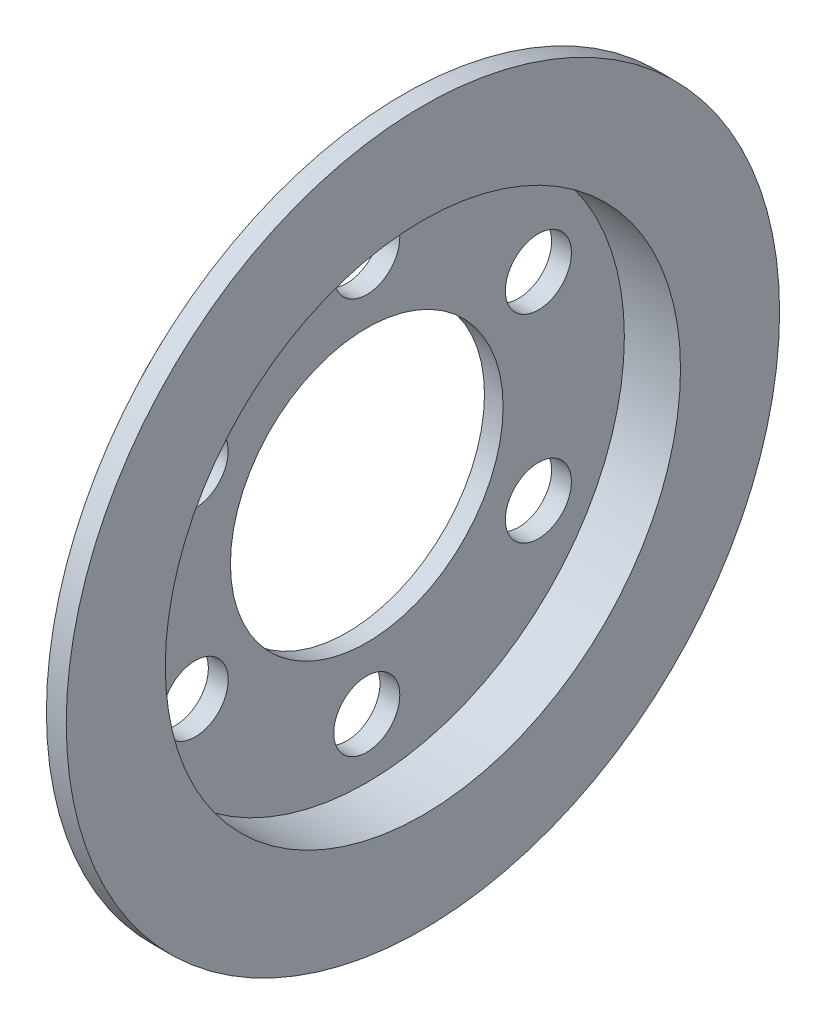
ISO-10303-21;
HEADER;
FILE_DESCRIPTION(('STEP AP214'),'2;1');
FILE_NAME('part.step','',(''),(''),'','','');
FILE_SCHEMA(('AUTOMOTIVE_DESIGN { 1 0 10303 214 1 1 1 1 }'));
ENDSEC;
DATA;
#1=APPLICATION_CONTEXT('core data for automotive mechanical design processes');
#2=APPLICATION_PROTOCOL_DEFINITION('international standard','automotive_design',2000,#1);
#3=PRODUCT_CONTEXT('',#1,'mechanical');
#4=PRODUCT('Part','Part','',(#3));
#5=PRODUCT_RELATED_PRODUCT_CATEGORY('part','',(#4));
#6=PRODUCT_DEFINITION_FORMATION('','',#4);
#7=PRODUCT_DEFINITION_CONTEXT('part definition',#1,'design');
#8=PRODUCT_DEFINITION('design','',#6,#7);
#9=PRODUCT_DEFINITION_SHAPE('','',#8);
#10=(LENGTH_UNIT() NAMED_UNIT(*) SI_UNIT(.MILLI.,.METRE.));
#11=(NAMED_UNIT(*) PLANE_ANGLE_UNIT() SI_UNIT($,.RADIAN.));
#12=(NAMED_UNIT(*) SI_UNIT($,.STERADIAN.) SOLID_ANGLE_UNIT());
#13=UNCERTAINTY_MEASURE_WITH_UNIT(LENGTH_MEASURE(1.E-05),#10,'distance_accuracy_value','');
#14=(GEOMETRIC_REPRESENTATION_CONTEXT(3) GLOBAL_UNCERTAINTY_ASSIGNED_CONTEXT((#13)) GLOBAL_UNIT_ASSIGNED_CONTEXT((#10,
#11,#12)) REPRESENTATION_CONTEXT('',''));
#15=CARTESIAN_POINT('',(0.,0.,0.));
#16=DIRECTION('',(0.,0.,1.));
#17=DIRECTION('',(1.,0.,0.));
#18=AXIS2_PLACEMENT_3D('',#15,#16,#17);
#19=CARTESIAN_POINT('',(7.99999999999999,0.,0.));
#20=DIRECTION('',(-1.,0.,0.));
#21=DIRECTION('',(0.,0.,1.));
#22=AXIS2_PLACEMENT_3D('',#19,#20,#21);
#23=CONICAL_SURFACE('',#22,20.82,0.0599281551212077);
#24=CARTESIAN_POINT('',(11.,0.,0.));
#25=DIRECTION('',(-1.,0.,0.));
#26=DIRECTION('',(0.,0.,1.));
#27=AXIS2_PLACEMENT_3D('',#24,#25,#26);
#28=CIRCLE('',#27,20.64);
#29=CARTESIAN_POINT('',(11.,0.,20.64));
#30=VERTEX_POINT('',#29);
#31=EDGE_CURVE('E58',#30,#30,#28,.T.);
#32=ORIENTED_EDGE('',*,*,#31,.F.);
#33=EDGE_LOOP('',(#32));
#34=FACE_BOUND('',#33,.T.);
#35=CARTESIAN_POINT('',(7.99999999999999,0.,0.));
#36=DIRECTION('',(-1.,0.,0.));
#37=DIRECTION('',(0.,0.,1.));
#38=AXIS2_PLACEMENT_3D('',#35,#36,#37);
#39=CIRCLE('',#38,20.82);
#40=CARTESIAN_POINT('',(7.99999999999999,0.,20.82));
#41=VERTEX_POINT('',#40);
#42=EDGE_CURVE('E10',#41,#41,#39,.T.);
#43=ORIENTED_EDGE('',*,*,#42,.T.);
#44=EDGE_LOOP('',(#43));
#45=FACE_BOUND('',#44,.T.);
#46=ADVANCED_FACE('F30',(#34,#45),#23,.F.);
#47=CARTESIAN_POINT('',(8.,20.82,0.));
#48=DIRECTION('',(1.,0.,0.));
#49=DIRECTION('',(0.,0.,-1.));
#50=AXIS2_PLACEMENT_3D('',#47,#48,#49);
#51=PLANE('',#50);
#52=CARTESIAN_POINT('',(8.,15.0000000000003,25.980762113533));
#53=DIRECTION('',(1.,0.,0.));
#54=DIRECTION('',(0.,0.,-1.));
#55=AXIS2_PLACEMENT_3D('',#52,#53,#54);
#56=CIRCLE('',#55,5.);
#57=CARTESIAN_POINT('',(8.,15.0000000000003,20.980762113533));
#58=VERTEX_POINT('',#57);
#59=EDGE_CURVE('E89',#58,#58,#56,.T.);
#60=ORIENTED_EDGE('',*,*,#59,.T.);
#61=EDGE_LOOP('',(#60));
#62=FACE_BOUND('',#61,.T.);
#63=CARTESIAN_POINT('',(8.,-14.9999999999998,25.9807621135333));
#64=DIRECTION('',(1.,0.,0.));
#65=DIRECTION('',(0.,0.,-1.));
#66=AXIS2_PLACEMENT_3D('',#63,#64,#65);
#67=CIRCLE('',#66,5.);
#68=CARTESIAN_POINT('',(8.,-14.9999999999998,20.9807621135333));
#69=VERTEX_POINT('',#68);
#70=EDGE_CURVE('E83',#69,#69,#67,.T.);
#71=ORIENTED_EDGE('',*,*,#70,.T.);
#72=EDGE_LOOP('',(#71));
#73=FACE_BOUND('',#72,.T.);
#74=CARTESIAN_POINT('',(8.,-30.,2.09489001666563E-13));
#75=DIRECTION('',(1.,0.,0.));
#76=DIRECTION('',(0.,0.,-1.));
#77=AXIS2_PLACEMENT_3D('',#74,#75,#76);
#78=CIRCLE('',#77,5.);
#79=CARTESIAN_POINT('',(8.,-30.,-4.99999999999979));
#80=VERTEX_POINT('',#79);
#81=EDGE_CURVE('E77',#80,#80,#78,.T.);
#82=ORIENTED_EDGE('',*,*,#81,.T.);
#83=EDGE_LOOP('',(#82));
#84=FACE_BOUND('',#83,.T.);
#85=CARTESIAN_POINT('',(8.,-15.0000000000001,-25.9807621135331));
#86=DIRECTION('',(1.,0.,0.));
#87=DIRECTION('',(0.,0.,-1.));
#88=AXIS2_PLACEMENT_3D('',#85,#86,#87);
#89=CIRCLE('',#88,5.);
#90=CARTESIAN_POINT('',(8.,-15.0000000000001,-30.9807621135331));
#91=VERTEX_POINT('',#90);
#92=EDGE_CURVE('E71',#91,#91,#89,.T.);
#93=ORIENTED_EDGE('',*,*,#92,.T.);
#94=EDGE_LOOP('',(#93));
#95=FACE_BOUND('',#94,.T.);
#96=CARTESIAN_POINT('',(8.,14.9999999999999,-25.9807621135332));
#97=DIRECTION('',(1.,0.,0.));
#98=DIRECTION('',(0.,0.,-1.));
#99=AXIS2_PLACEMENT_3D('',#96,#97,#98);
#100=CIRCLE('',#99,5.);
#101=CARTESIAN_POINT('',(8.,14.9999999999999,-30.9807621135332));
#102=VERTEX_POINT('',#101);
#103=EDGE_CURVE('E65',#102,#102,#100,.T.);
#104=ORIENTED_EDGE('',*,*,#103,.T.);
#105=EDGE_LOOP('',(#104));
#106=FACE_BOUND('',#105,.T.);
#107=CARTESIAN_POINT('',(8.,30.,0.));
#108=DIRECTION('',(1.,0.,0.));
#109=DIRECTION('',(0.,0.,-1.));
#110=AXIS2_PLACEMENT_3D('',#107,#108,#109);
#111=CIRCLE('',#110,5.);
#112=CARTESIAN_POINT('',(8.,30.,-5.));
#113=VERTEX_POINT('',#112);
#114=EDGE_CURVE('E61',#113,#113,#111,.T.);
#115=ORIENTED_EDGE('',*,*,#114,.T.);
#116=EDGE_LOOP('',(#115));
#117=FACE_BOUND('',#116,.T.);
#118=ORIENTED_EDGE('',*,*,#42,.F.);
#119=EDGE_LOOP('',(#118));
#120=FACE_BOUND('',#119,.T.);
#121=CARTESIAN_POINT('',(7.99999999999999,0.,0.));
#122=DIRECTION('',(-1.,0.,0.));
#123=DIRECTION('',(0.,0.,1.));
#124=AXIS2_PLACEMENT_3D('',#121,#122,#123);
#125=CIRCLE('',#124,42.);
#126=CARTESIAN_POINT('',(7.99999999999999,0.,42.));
#127=VERTEX_POINT('',#126);
#128=EDGE_CURVE('E36',#127,#127,#125,.T.);
#129=ORIENTED_EDGE('',*,*,#128,.T.);
#130=EDGE_LOOP('',(#129));
#131=FACE_BOUND('',#130,.T.);
#132=ADVANCED_FACE('F98',(#62,#73,#84,#95,#106,#117,#120,#131),#51,.F.);
#133=CARTESIAN_POINT('',(-58.272844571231,0.,0.));
#134=DIRECTION('',(-1.,0.,0.));
#135=DIRECTION('',(0.,0.,1.));
#136=AXIS2_PLACEMENT_3D('',#133,#134,#135);
#137=CYLINDRICAL_SURFACE('',#136,42.);
#138=ORIENTED_EDGE('',*,*,#128,.F.);
#139=EDGE_LOOP('',(#138));
#140=FACE_BOUND('',#139,.T.);
#141=CARTESIAN_POINT('',(16.5,0.,0.));
#142=DIRECTION('',(-1.,0.,0.));
#143=DIRECTION('',(0.,0.,1.));
#144=AXIS2_PLACEMENT_3D('',#141,#142,#143);
#145=CIRCLE('',#144,42.);
#146=CARTESIAN_POINT('',(16.5,0.,42.));
#147=VERTEX_POINT('',#146);
#148=EDGE_CURVE('E40',#147,#147,#145,.T.);
#149=ORIENTED_EDGE('',*,*,#148,.T.);
#150=EDGE_LOOP('',(#149));
#151=FACE_BOUND('',#150,.T.);
#152=ADVANCED_FACE('F132',(#140,#151),#137,.T.);
#153=CARTESIAN_POINT('',(16.5,42.,0.));
#154=DIRECTION('',(1.,0.,0.));
#155=DIRECTION('',(0.,0.,-1.));
#156=AXIS2_PLACEMENT_3D('',#153,#154,#155);
#157=PLANE('',#156);
#158=ORIENTED_EDGE('',*,*,#148,.F.);
#159=EDGE_LOOP('',(#158));
#160=FACE_BOUND('',#159,.T.);
#161=CARTESIAN_POINT('',(16.5,0.,0.));
#162=DIRECTION('',(-1.,0.,0.));
#163=DIRECTION('',(0.,0.,1.));
#164=AXIS2_PLACEMENT_3D('',#161,#162,#163);
#165=CIRCLE('',#164,54.);
#166=CARTESIAN_POINT('',(16.5,0.,54.));
#167=VERTEX_POINT('',#166);
#168=EDGE_CURVE('E44',#167,#167,#165,.T.);
#169=ORIENTED_EDGE('',*,*,#168,.T.);
#170=EDGE_LOOP('',(#169));
#171=FACE_BOUND('',#170,.T.);
#172=ADVANCED_FACE('F136',(#160,#171),#157,.F.);
#173=CARTESIAN_POINT('',(-58.272844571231,0.,0.));
#174=DIRECTION('',(-1.,0.,0.));
#175=DIRECTION('',(0.,0.,1.));
#176=AXIS2_PLACEMENT_3D('',#173,#174,#175);
#177=CYLINDRICAL_SURFACE('',#176,54.);
#178=ORIENTED_EDGE('',*,*,#168,.F.);
#179=EDGE_LOOP('',(#178));
#180=FACE_BOUND('',#179,.T.);
#181=CARTESIAN_POINT('',(19.5,0.,0.));
#182=DIRECTION('',(-1.,0.,0.));
#183=DIRECTION('',(0.,0.,1.));
#184=AXIS2_PLACEMENT_3D('',#181,#182,#183);
#185=CIRCLE('',#184,54.);
#186=CARTESIAN_POINT('',(19.5,0.,54.));
#187=VERTEX_POINT('',#186);
#188=EDGE_CURVE('E49',#187,#187,#185,.T.);
#189=ORIENTED_EDGE('',*,*,#188,.T.);
#190=EDGE_LOOP('',(#189));
#191=FACE_BOUND('',#190,.T.);
#192=ADVANCED_FACE('F142',(#180,#191),#177,.T.);
#193=CARTESIAN_POINT('',(19.5,54.,0.));
#194=DIRECTION('',(-1.,0.,0.));
#195=DIRECTION('',(0.,0.,1.));
#196=AXIS2_PLACEMENT_3D('',#193,#194,#195);
#197=PLANE('',#196);
#198=ORIENTED_EDGE('',*,*,#188,.F.);
#199=EDGE_LOOP('',(#198));
#200=FACE_BOUND('',#199,.T.);
#201=CARTESIAN_POINT('',(19.5,0.,0.));
#202=DIRECTION('',(-1.,0.,0.));
#203=DIRECTION('',(0.,0.,1.));
#204=AXIS2_PLACEMENT_3D('',#201,#202,#203);
#205=CIRCLE('',#204,39.);
#206=CARTESIAN_POINT('',(19.5,0.,39.));
#207=VERTEX_POINT('',#206);
#208=EDGE_CURVE('E52',#207,#207,#205,.T.);
#209=ORIENTED_EDGE('',*,*,#208,.T.);
#210=EDGE_LOOP('',(#209));
#211=FACE_BOUND('',#210,.T.);
#212=ADVANCED_FACE('F146',(#200,#211),#197,.F.);
#213=CARTESIAN_POINT('',(-58.272844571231,0.,0.));
#214=DIRECTION('',(-1.,0.,0.));
#215=DIRECTION('',(0.,0.,1.));
#216=AXIS2_PLACEMENT_3D('',#213,#214,#215);
#217=CYLINDRICAL_SURFACE('',#216,39.);
#218=ORIENTED_EDGE('',*,*,#208,.F.);
#219=EDGE_LOOP('',(#218));
#220=FACE_BOUND('',#219,.T.);
#221=CARTESIAN_POINT('',(11.,0.,0.));
#222=DIRECTION('',(-1.,0.,0.));
#223=DIRECTION('',(0.,0.,1.));
#224=AXIS2_PLACEMENT_3D('',#221,#222,#223);
#225=CIRCLE('',#224,39.);
#226=CARTESIAN_POINT('',(11.,0.,39.));
#227=VERTEX_POINT('',#226);
#228=EDGE_CURVE('E55',#227,#227,#225,.T.);
#229=ORIENTED_EDGE('',*,*,#228,.T.);
#230=EDGE_LOOP('',(#229));
#231=FACE_BOUND('',#230,.T.);
#232=ADVANCED_FACE('F112',(#220,#231),#217,.F.);
#233=CARTESIAN_POINT('',(11.,39.,0.));
#234=DIRECTION('',(-1.,0.,0.));
#235=DIRECTION('',(0.,0.,1.));
#236=AXIS2_PLACEMENT_3D('',#233,#234,#235);
#237=PLANE('',#236);
#238=CARTESIAN_POINT('',(11.,15.0000000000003,25.980762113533));
#239=DIRECTION('',(1.,0.,0.));
#240=DIRECTION('',(0.,0.,-1.));
#241=AXIS2_PLACEMENT_3D('',#238,#239,#240);
#242=CIRCLE('',#241,5.);
#243=CARTESIAN_POINT('',(11.,15.0000000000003,20.980762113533));
#244=VERTEX_POINT('',#243);
#245=EDGE_CURVE('E92',#244,#244,#242,.T.);
#246=ORIENTED_EDGE('',*,*,#245,.F.);
#247=EDGE_LOOP('',(#246));
#248=FACE_BOUND('',#247,.T.);
#249=CARTESIAN_POINT('',(11.,-14.9999999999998,25.9807621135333));
#250=DIRECTION('',(1.,0.,0.));
#251=DIRECTION('',(0.,0.,-1.));
#252=AXIS2_PLACEMENT_3D('',#249,#250,#251);
#253=CIRCLE('',#252,5.);
#254=CARTESIAN_POINT('',(11.,-14.9999999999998,20.9807621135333));
#255=VERTEX_POINT('',#254);
#256=EDGE_CURVE('E86',#255,#255,#253,.T.);
#257=ORIENTED_EDGE('',*,*,#256,.F.);
#258=EDGE_LOOP('',(#257));
#259=FACE_BOUND('',#258,.T.);
#260=CARTESIAN_POINT('',(11.,-30.,2.09489001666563E-13));
#261=DIRECTION('',(1.,0.,0.));
#262=DIRECTION('',(0.,0.,-1.));
#263=AXIS2_PLACEMENT_3D('',#260,#261,#262);
#264=CIRCLE('',#263,5.);
#265=CARTESIAN_POINT('',(11.,-30.,-4.99999999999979));
#266=VERTEX_POINT('',#265);
#267=EDGE_CURVE('E80',#266,#266,#264,.T.);
#268=ORIENTED_EDGE('',*,*,#267,.F.);
#269=EDGE_LOOP('',(#268));
#270=FACE_BOUND('',#269,.T.);
#271=CARTESIAN_POINT('',(11.,-15.0000000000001,-25.9807621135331));
#272=DIRECTION('',(1.,0.,0.));
#273=DIRECTION('',(0.,0.,-1.));
#274=AXIS2_PLACEMENT_3D('',#271,#272,#273);
#275=CIRCLE('',#274,5.);
#276=CARTESIAN_POINT('',(11.,-15.0000000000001,-30.9807621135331));
#277=VERTEX_POINT('',#276);
#278=EDGE_CURVE('E74',#277,#277,#275,.T.);
#279=ORIENTED_EDGE('',*,*,#278,.F.);
#280=EDGE_LOOP('',(#279));
#281=FACE_BOUND('',#280,.T.);
#282=CARTESIAN_POINT('',(11.,14.9999999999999,-25.9807621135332));
#283=DIRECTION('',(1.,0.,0.));
#284=DIRECTION('',(0.,0.,-1.));
#285=AXIS2_PLACEMENT_3D('',#282,#283,#284);
#286=CIRCLE('',#285,5.);
#287=CARTESIAN_POINT('',(11.,14.9999999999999,-30.9807621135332));
#288=VERTEX_POINT('',#287);
#289=EDGE_CURVE('E68',#288,#288,#286,.T.);
#290=ORIENTED_EDGE('',*,*,#289,.F.);
#291=EDGE_LOOP('',(#290));
#292=FACE_BOUND('',#291,.T.);
#293=CARTESIAN_POINT('',(11.,30.,0.));
#294=DIRECTION('',(1.,0.,0.));
#295=DIRECTION('',(0.,0.,-1.));
#296=AXIS2_PLACEMENT_3D('',#293,#294,#295);
#297=CIRCLE('',#296,5.);
#298=CARTESIAN_POINT('',(11.,30.,-5.));
#299=VERTEX_POINT('',#298);
#300=EDGE_CURVE('E62',#299,#299,#297,.T.);
#301=ORIENTED_EDGE('',*,*,#300,.F.);
#302=EDGE_LOOP('',(#301));
#303=FACE_BOUND('',#302,.T.);
#304=ORIENTED_EDGE('',*,*,#228,.F.);
#305=EDGE_LOOP('',(#304));
#306=FACE_BOUND('',#305,.T.);
#307=ORIENTED_EDGE('',*,*,#31,.T.);
#308=EDGE_LOOP('',(#307));
#309=FACE_BOUND('',#308,.T.);
#310=ADVANCED_FACE('F108',(#248,#259,#270,#281,#292,#303,#306,#309),#237,.F.);
#311=CARTESIAN_POINT('',(8.,30.,0.));
#312=DIRECTION('',(1.,0.,0.));
#313=DIRECTION('',(0.,0.,-1.));
#314=AXIS2_PLACEMENT_3D('',#311,#312,#313);
#315=CYLINDRICAL_SURFACE('',#314,5.);
#316=ORIENTED_EDGE('',*,*,#114,.F.);
#317=EDGE_LOOP('',(#316));
#318=FACE_BOUND('',#317,.T.);
#319=ORIENTED_EDGE('',*,*,#300,.T.);
#320=EDGE_LOOP('',(#319));
#321=FACE_BOUND('',#320,.T.);
#322=ADVANCED_FACE('F111',(#318,#321),#315,.F.);
#323=CARTESIAN_POINT('',(8.,14.9999999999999,-25.9807621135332));
#324=DIRECTION('',(1.,0.,0.));
#325=DIRECTION('',(0.,0.,-1.));
#326=AXIS2_PLACEMENT_3D('',#323,#324,#325);
#327=CYLINDRICAL_SURFACE('',#326,5.);
#328=ORIENTED_EDGE('',*,*,#103,.F.);
#329=EDGE_LOOP('',(#328));
#330=FACE_BOUND('',#329,.T.);
#331=ORIENTED_EDGE('',*,*,#289,.T.);
#332=EDGE_LOOP('',(#331));
#333=FACE_BOUND('',#332,.T.);
#334=ADVANCED_FACE('F156',(#330,#333),#327,.F.);
#335=CARTESIAN_POINT('',(8.,-15.0000000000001,-25.9807621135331));
#336=DIRECTION('',(1.,0.,0.));
#337=DIRECTION('',(0.,0.,-1.));
#338=AXIS2_PLACEMENT_3D('',#335,#336,#337);
#339=CYLINDRICAL_SURFACE('',#338,5.);
#340=ORIENTED_EDGE('',*,*,#92,.F.);
#341=EDGE_LOOP('',(#340));
#342=FACE_BOUND('',#341,.T.);
#343=ORIENTED_EDGE('',*,*,#278,.T.);
#344=EDGE_LOOP('',(#343));
#345=FACE_BOUND('',#344,.T.);
#346=ADVANCED_FACE('F160',(#342,#345),#339,.F.);
#347=CARTESIAN_POINT('',(8.,-30.,2.09489001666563E-13));
#348=DIRECTION('',(1.,0.,0.));
#349=DIRECTION('',(0.,0.,-1.));
#350=AXIS2_PLACEMENT_3D('',#347,#348,#349);
#351=CYLINDRICAL_SURFACE('',#350,5.);
#352=ORIENTED_EDGE('',*,*,#81,.F.);
#353=EDGE_LOOP('',(#352));
#354=FACE_BOUND('',#353,.T.);
#355=ORIENTED_EDGE('',*,*,#267,.T.);
#356=EDGE_LOOP('',(#355));
#357=FACE_BOUND('',#356,.T.);
#358=ADVANCED_FACE('F164',(#354,#357),#351,.F.);
#359=CARTESIAN_POINT('',(8.,-14.9999999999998,25.9807621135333));
#360=DIRECTION('',(1.,0.,0.));
#361=DIRECTION('',(0.,0.,-1.));
#362=AXIS2_PLACEMENT_3D('',#359,#360,#361);
#363=CYLINDRICAL_SURFACE('',#362,5.);
#364=ORIENTED_EDGE('',*,*,#70,.F.);
#365=EDGE_LOOP('',(#364));
#366=FACE_BOUND('',#365,.T.);
#367=ORIENTED_EDGE('',*,*,#256,.T.);
#368=EDGE_LOOP('',(#367));
#369=FACE_BOUND('',#368,.T.);
#370=ADVANCED_FACE('F104',(#366,#369),#363,.F.);
#371=CARTESIAN_POINT('',(8.,15.0000000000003,25.980762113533));
#372=DIRECTION('',(1.,0.,0.));
#373=DIRECTION('',(0.,0.,-1.));
#374=AXIS2_PLACEMENT_3D('',#371,#372,#373);
#375=CYLINDRICAL_SURFACE('',#374,5.);
#376=ORIENTED_EDGE('',*,*,#59,.F.);
#377=EDGE_LOOP('',(#376));
#378=FACE_BOUND('',#377,.T.);
#379=ORIENTED_EDGE('',*,*,#245,.T.);
#380=EDGE_LOOP('',(#379));
#381=FACE_BOUND('',#380,.T.);
#382=ADVANCED_FACE('F101',(#378,#381),#375,.F.);
#383=CLOSED_SHELL('',(#46,#132,#152,#172,#192,#212,#232,#310,#322,#334,#346,#358,#370,#382));
#384=MANIFOLD_SOLID_BREP('B2',#383);
#385=ADVANCED_BREP_SHAPE_REPRESENTATION('',(#18,#384),#14);
#386=SHAPE_DEFINITION_REPRESENTATION(#9,#385);
ENDSEC;
END-ISO-10303-21;
